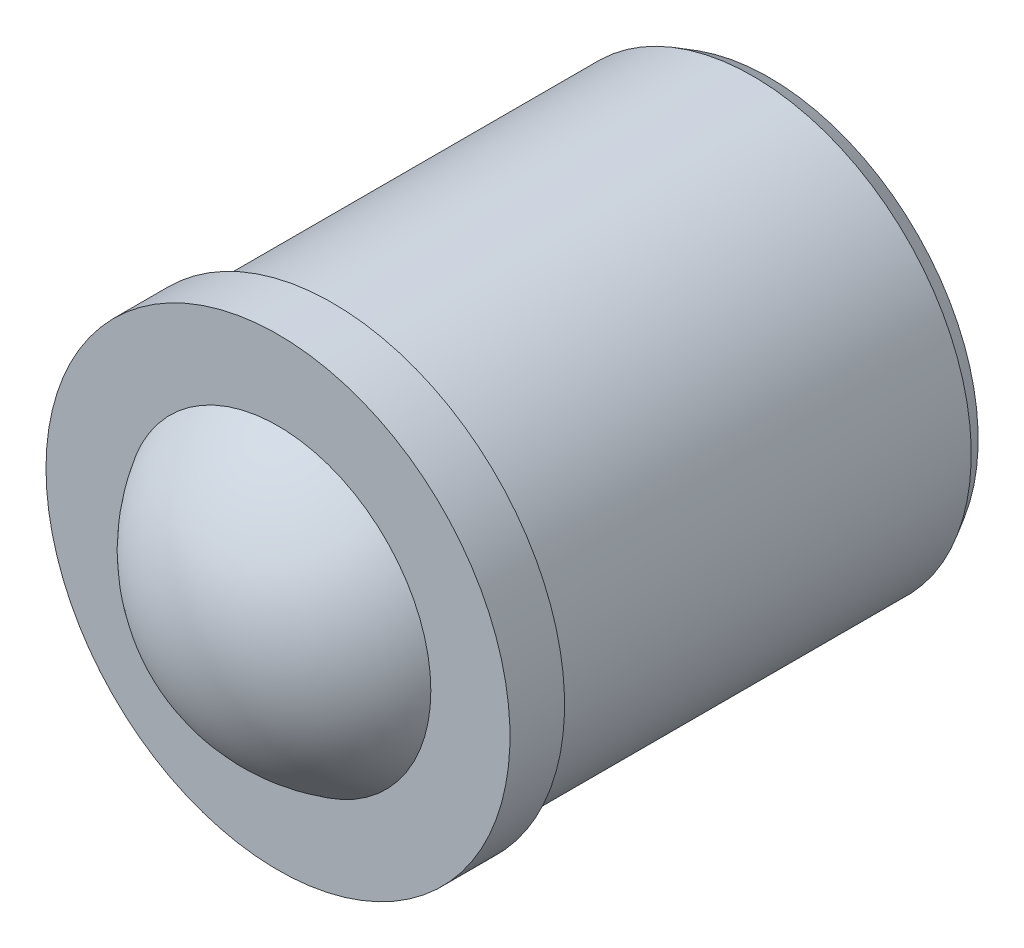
ISO-10303-21;
HEADER;
FILE_DESCRIPTION(('STEP AP214'),'2;1');
FILE_NAME('part.step','',(''),(''),'','','');
FILE_SCHEMA(('AUTOMOTIVE_DESIGN { 1 0 10303 214 1 1 1 1 }'));
ENDSEC;
DATA;
#1=APPLICATION_CONTEXT('core data for automotive mechanical design processes');
#2=APPLICATION_PROTOCOL_DEFINITION('international standard','automotive_design',2000,#1);
#3=PRODUCT_CONTEXT('',#1,'mechanical');
#4=PRODUCT('Part','Part','',(#3));
#5=PRODUCT_RELATED_PRODUCT_CATEGORY('part','',(#4));
#6=PRODUCT_DEFINITION_FORMATION('','',#4);
#7=PRODUCT_DEFINITION_CONTEXT('part definition',#1,'design');
#8=PRODUCT_DEFINITION('design','',#6,#7);
#9=PRODUCT_DEFINITION_SHAPE('','',#8);
#10=(LENGTH_UNIT() NAMED_UNIT(*) SI_UNIT(.MILLI.,.METRE.));
#11=(NAMED_UNIT(*) PLANE_ANGLE_UNIT() SI_UNIT($,.RADIAN.));
#12=(NAMED_UNIT(*) SI_UNIT($,.STERADIAN.) SOLID_ANGLE_UNIT());
#13=UNCERTAINTY_MEASURE_WITH_UNIT(LENGTH_MEASURE(1.E-05),#10,'distance_accuracy_value','');
#14=(GEOMETRIC_REPRESENTATION_CONTEXT(3) GLOBAL_UNCERTAINTY_ASSIGNED_CONTEXT((#13)) GLOBAL_UNIT_ASSIGNED_CONTEXT((#10,
#11,#12)) REPRESENTATION_CONTEXT('',''));
#15=CARTESIAN_POINT('',(0.,0.,0.));
#16=DIRECTION('',(0.,0.,1.));
#17=DIRECTION('',(1.,0.,0.));
#18=AXIS2_PLACEMENT_3D('',#15,#16,#17);
#19=CARTESIAN_POINT('',(0.,0.,-8.));
#20=DIRECTION('',(0.,0.,1.));
#21=DIRECTION('',(-1.,0.,0.));
#22=AXIS2_PLACEMENT_3D('',#19,#20,#21);
#23=PLANE('',#22);
#24=CARTESIAN_POINT('',(0.,0.,-8.));
#25=DIRECTION('',(0.,0.,1.));
#26=DIRECTION('',(-1.,0.,0.));
#27=AXIS2_PLACEMENT_3D('',#24,#25,#26);
#28=CIRCLE('',#27,3.82679491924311);
#29=CARTESIAN_POINT('',(-3.82679491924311,0.,-8.));
#30=VERTEX_POINT('',#29);
#31=EDGE_CURVE('E18',#30,#30,#28,.T.);
#32=ORIENTED_EDGE('',*,*,#31,.F.);
#33=EDGE_LOOP('',(#32));
#34=FACE_BOUND('',#33,.T.);
#35=ADVANCED_FACE('F12',(#34),#23,.F.);
#36=CARTESIAN_POINT('',(0.,0.,-8.));
#37=DIRECTION('',(0.,0.,1.));
#38=DIRECTION('',(-1.,0.,0.));
#39=AXIS2_PLACEMENT_3D('',#36,#37,#38);
#40=CONICAL_SURFACE('',#39,3.82679491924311,0.523598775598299);
#41=CARTESIAN_POINT('',(0.,0.,-7.7));
#42=DIRECTION('',(0.,0.,1.));
#43=DIRECTION('',(-1.,0.,0.));
#44=AXIS2_PLACEMENT_3D('',#41,#42,#43);
#45=CIRCLE('',#44,4.);
#46=CARTESIAN_POINT('',(-4.,0.,-7.7));
#47=VERTEX_POINT('',#46);
#48=EDGE_CURVE('E22',#47,#47,#45,.T.);
#49=ORIENTED_EDGE('',*,*,#48,.F.);
#50=EDGE_LOOP('',(#49));
#51=FACE_BOUND('',#50,.T.);
#52=ORIENTED_EDGE('',*,*,#31,.T.);
#53=EDGE_LOOP('',(#52));
#54=FACE_BOUND('',#53,.T.);
#55=ADVANCED_FACE('F55',(#51,#54),#40,.T.);
#56=CARTESIAN_POINT('',(0.,0.,1.));
#57=DIRECTION('',(0.,0.,1.));
#58=DIRECTION('',(-1.,0.,0.));
#59=AXIS2_PLACEMENT_3D('',#56,#57,#58);
#60=CYLINDRICAL_SURFACE('',#59,4.);
#61=CARTESIAN_POINT('',(0.,0.,0.));
#62=DIRECTION('',(0.,0.,1.));
#63=DIRECTION('',(-1.,0.,0.));
#64=AXIS2_PLACEMENT_3D('',#61,#62,#63);
#65=CIRCLE('',#64,4.);
#66=CARTESIAN_POINT('',(-4.,0.,0.));
#67=VERTEX_POINT('',#66);
#68=EDGE_CURVE('E26',#67,#67,#65,.T.);
#69=ORIENTED_EDGE('',*,*,#68,.F.);
#70=EDGE_LOOP('',(#69));
#71=FACE_BOUND('',#70,.T.);
#72=ORIENTED_EDGE('',*,*,#48,.T.);
#73=EDGE_LOOP('',(#72));
#74=FACE_BOUND('',#73,.T.);
#75=ADVANCED_FACE('F49',(#71,#74),#60,.T.);
#76=CARTESIAN_POINT('',(-4.,0.,0.));
#77=DIRECTION('',(0.,0.,1.));
#78=DIRECTION('',(-1.,0.,0.));
#79=AXIS2_PLACEMENT_3D('',#76,#77,#78);
#80=PLANE('',#79);
#81=CARTESIAN_POINT('',(0.,0.,0.));
#82=DIRECTION('',(0.,0.,1.));
#83=DIRECTION('',(-1.,0.,0.));
#84=AXIS2_PLACEMENT_3D('',#81,#82,#83);
#85=CIRCLE('',#84,4.25);
#86=CARTESIAN_POINT('',(-4.25,0.,0.));
#87=VERTEX_POINT('',#86);
#88=EDGE_CURVE('E31',#87,#87,#85,.T.);
#89=ORIENTED_EDGE('',*,*,#88,.F.);
#90=EDGE_LOOP('',(#89));
#91=FACE_BOUND('',#90,.T.);
#92=ORIENTED_EDGE('',*,*,#68,.T.);
#93=EDGE_LOOP('',(#92));
#94=FACE_BOUND('',#93,.T.);
#95=ADVANCED_FACE('F43',(#91,#94),#80,.F.);
#96=CARTESIAN_POINT('',(0.,0.,1.));
#97=DIRECTION('',(0.,0.,1.));
#98=DIRECTION('',(-1.,0.,0.));
#99=AXIS2_PLACEMENT_3D('',#96,#97,#98);
#100=CYLINDRICAL_SURFACE('',#99,4.25);
#101=CARTESIAN_POINT('',(0.,0.,1.));
#102=DIRECTION('',(0.,0.,1.));
#103=DIRECTION('',(-1.,0.,0.));
#104=AXIS2_PLACEMENT_3D('',#101,#102,#103);
#105=CIRCLE('',#104,4.25);
#106=CARTESIAN_POINT('',(-4.25,0.,1.));
#107=VERTEX_POINT('',#106);
#108=EDGE_CURVE('E34',#107,#107,#105,.T.);
#109=ORIENTED_EDGE('',*,*,#108,.F.);
#110=EDGE_LOOP('',(#109));
#111=FACE_BOUND('',#110,.T.);
#112=ORIENTED_EDGE('',*,*,#88,.T.);
#113=EDGE_LOOP('',(#112));
#114=FACE_BOUND('',#113,.T.);
#115=ADVANCED_FACE('F40',(#111,#114),#100,.T.);
#116=CARTESIAN_POINT('',(-4.25,0.,1.));
#117=DIRECTION('',(0.,0.,-1.));
#118=DIRECTION('',(1.,0.,0.));
#119=AXIS2_PLACEMENT_3D('',#116,#117,#118);
#120=PLANE('',#119);
#121=ORIENTED_EDGE('',*,*,#108,.T.);
#122=EDGE_LOOP('',(#121));
#123=FACE_BOUND('',#122,.T.);
#124=CARTESIAN_POINT('',(0.,0.,1.));
#125=DIRECTION('',(0.,0.,1.));
#126=DIRECTION('',(-1.,0.,0.));
#127=AXIS2_PLACEMENT_3D('',#124,#125,#126);
#128=CIRCLE('',#127,2.8);
#129=CARTESIAN_POINT('',(-2.8,0.,1.));
#130=VERTEX_POINT('',#129);
#131=EDGE_CURVE('E8',#130,#130,#128,.F.);
#132=ORIENTED_EDGE('',*,*,#131,.T.);
#133=EDGE_LOOP('',(#132));
#134=FACE_BOUND('',#133,.T.);
#135=ADVANCED_FACE('F38',(#123,#134),#120,.F.);
#136=CARTESIAN_POINT('',(0.,0.,-0.65));
#137=DIRECTION('',(0.,0.,-1.));
#138=DIRECTION('',(-1.,0.,0.));
#139=AXIS2_PLACEMENT_3D('',#136,#137,#138);
#140=SPHERICAL_SURFACE('',#139,3.25);
#141=ORIENTED_EDGE('',*,*,#131,.F.);
#142=EDGE_LOOP('',(#141));
#143=FACE_BOUND('',#142,.T.);
#144=ADVANCED_FACE('F68',(#143),#140,.T.);
#145=CLOSED_SHELL('',(#35,#55,#75,#95,#115,#135,#144));
#146=MANIFOLD_SOLID_BREP('B1',#145);
#147=ADVANCED_BREP_SHAPE_REPRESENTATION('',(#18,#146),#14);
#148=SHAPE_DEFINITION_REPRESENTATION(#9,#147);
ENDSEC;
END-ISO-10303-21;
